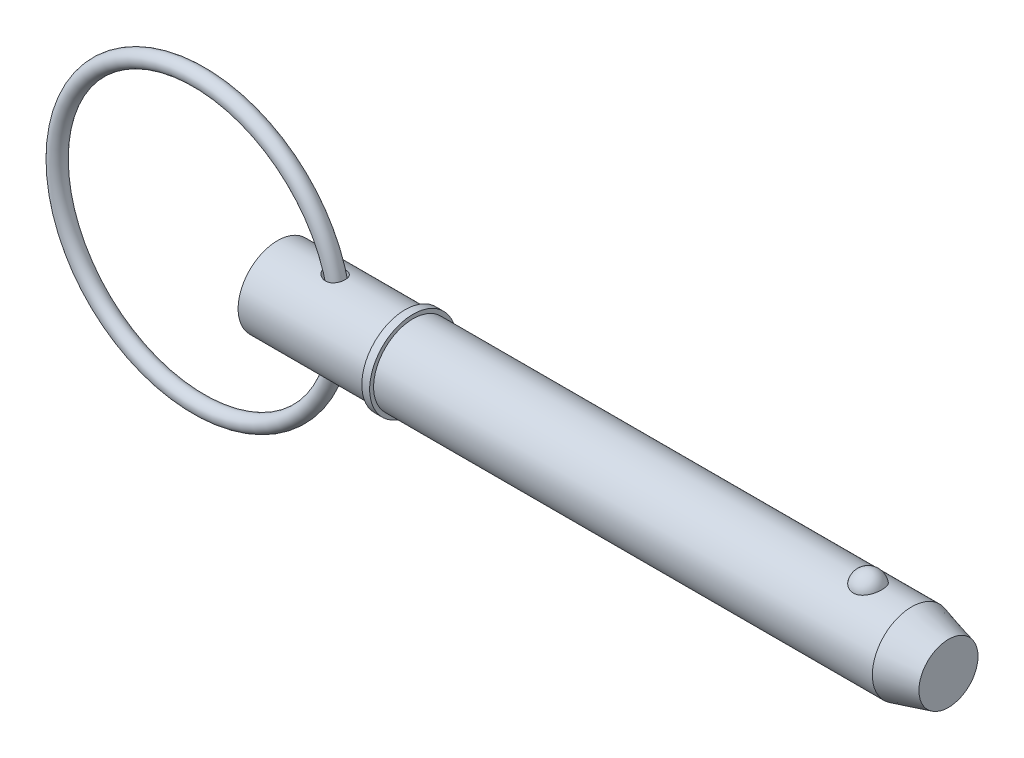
ISO-10303-21;
HEADER;
FILE_DESCRIPTION(('STEP AP214'),'2;1');
FILE_NAME('part.step','',(''),(''),'','','');
FILE_SCHEMA(('AUTOMOTIVE_DESIGN { 1 0 10303 214 1 1 1 1 }'));
ENDSEC;
DATA;
#1=APPLICATION_CONTEXT('core data for automotive mechanical design processes');
#2=APPLICATION_PROTOCOL_DEFINITION('international standard','automotive_design',2000,#1);
#3=PRODUCT_CONTEXT('',#1,'mechanical');
#4=PRODUCT('Part','Part','',(#3));
#5=PRODUCT_RELATED_PRODUCT_CATEGORY('part','',(#4));
#6=PRODUCT_DEFINITION_FORMATION('','',#4);
#7=PRODUCT_DEFINITION_CONTEXT('part definition',#1,'design');
#8=PRODUCT_DEFINITION('design','',#6,#7);
#9=PRODUCT_DEFINITION_SHAPE('','',#8);
#10=(LENGTH_UNIT() NAMED_UNIT(*) SI_UNIT(.MILLI.,.METRE.));
#11=(NAMED_UNIT(*) PLANE_ANGLE_UNIT() SI_UNIT($,.RADIAN.));
#12=(NAMED_UNIT(*) SI_UNIT($,.STERADIAN.) SOLID_ANGLE_UNIT());
#13=UNCERTAINTY_MEASURE_WITH_UNIT(LENGTH_MEASURE(1.E-05),#10,'distance_accuracy_value','');
#14=(GEOMETRIC_REPRESENTATION_CONTEXT(3) GLOBAL_UNCERTAINTY_ASSIGNED_CONTEXT((#13)) GLOBAL_UNIT_ASSIGNED_CONTEXT((#10,
#11,#12)) REPRESENTATION_CONTEXT('',''));
#15=CARTESIAN_POINT('',(0.,0.,0.));
#16=DIRECTION('',(0.,0.,1.));
#17=DIRECTION('',(1.,0.,0.));
#18=AXIS2_PLACEMENT_3D('',#15,#16,#17);
#19=CARTESIAN_POINT('',(-15.855506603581,0.,0.));
#20=DIRECTION('',(0.,0.,1.));
#21=DIRECTION('',(1.,0.,0.));
#22=AXIS2_PLACEMENT_3D('',#19,#20,#21);
#23=TOROIDAL_SURFACE('',#22,28.575,1.588);
#24=CARTESIAN_POINT('',(14.307493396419,0.,0.));
#25=VERTEX_POINT('',#24);
#26=VERTEX_LOOP('',#25);
#27=FACE_BOUND('',#26,.T.);
#28=ADVANCED_FACE('P0_F12',(#27),#23,.T.);
#29=CLOSED_SHELL('',(#28));
#30=MANIFOLD_SOLID_BREP('P0_B1',#29);
#31=CARTESIAN_POINT('',(0.,0.,0.));
#32=DIRECTION('',(1.,0.,0.));
#33=DIRECTION('',(0.,0.,-1.));
#34=AXIS2_PLACEMENT_3D('',#31,#32,#33);
#35=CYLINDRICAL_SURFACE('',#34,7.94);
#36=CARTESIAN_POINT('',(9.9064878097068,7.8609270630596,-1.11777712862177));
#37=CARTESIAN_POINT('',(9.98046148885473,7.84701054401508,-1.21564239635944));
#38=CARTESIAN_POINT('',(10.0632949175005,7.83217804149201,-1.30680329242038));
#39=CARTESIAN_POINT('',(10.243327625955,7.80247884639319,-1.47382688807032));
#40=CARTESIAN_POINT('',(10.3405572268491,7.78761214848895,-1.54965647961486));
#41=CARTESIAN_POINT('',(10.5460150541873,7.75960959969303,-1.6842723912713));
#42=CARTESIAN_POINT('',(10.654212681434,7.74646915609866,-1.74310445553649));
#43=CARTESIAN_POINT('',(10.8789333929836,7.72340979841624,-1.84259563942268));
#44=CARTESIAN_POINT('',(10.9954527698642,7.71348946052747,-1.88326279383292));
#45=CARTESIAN_POINT('',(11.2371543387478,7.69793327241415,-1.94589519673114));
#46=CARTESIAN_POINT('',(11.3624861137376,7.69242163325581,-1.96732022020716));
#47=CARTESIAN_POINT('',(11.6151110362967,7.68708151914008,-1.98809161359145));
#48=CARTESIAN_POINT('',(11.7424035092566,7.68725113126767,-1.98744541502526));
#49=CARTESIAN_POINT('',(11.9871377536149,7.69329740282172,-1.96389977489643));
#50=CARTESIAN_POINT('',(12.1047148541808,7.69883374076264,-1.94232728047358));
#51=CARTESIAN_POINT('',(12.3339179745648,7.7145667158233,-1.87886184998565));
#52=CARTESIAN_POINT('',(12.4455463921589,7.72476145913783,-1.83697717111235));
#53=CARTESIAN_POINT('',(12.6521036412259,7.74778151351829,-1.73721211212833));
#54=CARTESIAN_POINT('',(12.7476463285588,7.76039274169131,-1.68054854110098));
#55=CARTESIAN_POINT('',(12.9274536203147,7.78715828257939,-1.55179691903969));
#56=CARTESIAN_POINT('',(13.0117191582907,7.80131246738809,-1.47971014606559));
#57=CARTESIAN_POINT('',(13.16544092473,7.82932755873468,-1.32341211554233));
#58=CARTESIAN_POINT('',(13.2351086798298,7.84318958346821,-1.23940873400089));
#59=CARTESIAN_POINT('',(13.3595610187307,7.86933512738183,-1.06080152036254));
#60=CARTESIAN_POINT('',(13.4143450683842,7.88161858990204,-0.966197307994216));
#61=CARTESIAN_POINT('',(13.5082288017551,7.90340571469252,-0.767990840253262));
#62=CARTESIAN_POINT('',(13.5471601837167,7.91287927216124,-0.664305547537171));
#63=CARTESIAN_POINT('',(13.6076213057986,7.92785679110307,-0.451705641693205));
#64=CARTESIAN_POINT('',(13.6291504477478,7.93336061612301,-0.3427908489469));
#65=CARTESIAN_POINT('',(13.6544025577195,7.93983472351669,-0.122042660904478));
#66=CARTESIAN_POINT('',(13.6580055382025,7.94077445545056,-0.0101946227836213));
#67=CARTESIAN_POINT('',(13.6469977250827,7.93793630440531,0.212542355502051));
#68=CARTESIAN_POINT('',(13.6323866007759,7.93415833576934,0.323431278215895));
#69=CARTESIAN_POINT('',(13.5852649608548,7.92228583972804,0.541194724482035));
#70=CARTESIAN_POINT('',(13.5527398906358,7.91418780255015,0.648065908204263));
#71=CARTESIAN_POINT('',(13.4705326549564,7.8945509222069,0.854658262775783));
#72=CARTESIAN_POINT('',(13.4208502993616,7.88301204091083,0.954379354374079));
#73=CARTESIAN_POINT('',(13.3056021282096,7.85778224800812,1.14366619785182));
#74=CARTESIAN_POINT('',(13.2400609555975,7.8440946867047,1.23324739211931));
#75=CARTESIAN_POINT('',(13.0946981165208,7.8160855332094,1.39984119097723));
#76=CARTESIAN_POINT('',(13.0148777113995,7.80176399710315,1.47685490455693));
#77=CARTESIAN_POINT('',(12.8438529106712,7.774237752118,1.6154855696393));
#78=CARTESIAN_POINT('',(12.7527554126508,7.76102428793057,1.67723263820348));
#79=CARTESIAN_POINT('',(12.5611987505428,7.73705789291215,1.78453696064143));
#80=CARTESIAN_POINT('',(12.4607407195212,7.72630466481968,1.83009617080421));
#81=CARTESIAN_POINT('',(12.2541997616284,7.70849465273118,1.90371822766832));
#82=CARTESIAN_POINT('',(12.1481665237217,7.7014098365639,1.93191408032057));
#83=CARTESIAN_POINT('',(11.9327851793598,7.69148605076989,1.97105353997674));
#84=CARTESIAN_POINT('',(11.8234367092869,7.68864754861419,1.98199524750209));
#85=CARTESIAN_POINT('',(11.6016024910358,7.68735890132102,1.98698770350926));
#86=CARTESIAN_POINT('',(11.4891069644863,7.68902083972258,1.98060702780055));
#87=CARTESIAN_POINT('',(11.2665484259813,7.6966276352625,1.95083303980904));
#88=CARTESIAN_POINT('',(11.1564861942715,7.70257384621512,1.92743434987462));
#89=CARTESIAN_POINT('',(10.9339966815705,7.71853798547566,1.86251478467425));
#90=CARTESIAN_POINT('',(10.8219140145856,7.72880438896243,1.81987394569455));
#91=CARTESIAN_POINT('',(10.6060441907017,7.75216432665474,1.7176403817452));
#92=CARTESIAN_POINT('',(10.5022611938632,7.76525926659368,1.65803922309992));
#93=CARTESIAN_POINT('',(10.3000447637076,7.79362794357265,1.51929354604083));
#94=CARTESIAN_POINT('',(10.2022480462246,7.80898310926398,1.4392327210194));
#95=CARTESIAN_POINT('',(10.0221668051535,7.83939672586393,1.26310118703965));
#96=CARTESIAN_POINT('',(9.93988168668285,7.85445518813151,1.16703109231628));
#97=CARTESIAN_POINT('',(9.79729823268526,7.88178950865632,0.964874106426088));
#98=CARTESIAN_POINT('',(9.73627994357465,7.89414970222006,0.859310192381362));
#99=CARTESIAN_POINT('',(9.63554001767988,7.91508909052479,0.638143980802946));
#100=CARTESIAN_POINT('',(9.59578986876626,7.92367334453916,0.52255536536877));
#101=CARTESIAN_POINT('',(9.54388714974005,7.93499161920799,0.300466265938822));
#102=CARTESIAN_POINT('',(9.52888458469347,7.93832727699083,0.194660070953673));
#103=CARTESIAN_POINT('',(9.51823078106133,7.94068976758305,-0.0179747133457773));
#104=CARTESIAN_POINT('',(9.52257317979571,7.93971801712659,-0.124802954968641));
#105=CARTESIAN_POINT('',(9.54911264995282,7.93386114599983,-0.326814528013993));
#106=CARTESIAN_POINT('',(9.56976509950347,7.92931471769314,-0.422217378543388));
#107=CARTESIAN_POINT('',(9.62591284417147,7.91721462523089,-0.608271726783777));
#108=CARTESIAN_POINT('',(9.66139801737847,7.90966301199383,-0.698926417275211));
#109=CARTESIAN_POINT('',(9.7317197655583,7.89515389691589,-0.844763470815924));
#110=CARTESIAN_POINT('',(9.76292633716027,7.88881879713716,-0.90180107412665));
#111=CARTESIAN_POINT('',(9.83075962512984,7.87538342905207,-1.01244242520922));
#112=CARTESIAN_POINT('',(9.86738597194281,7.86828321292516,-1.06604640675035));
#113=CARTESIAN_POINT('',(9.9064878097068,7.8609270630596,-1.11777712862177));
#114=B_SPLINE_CURVE_WITH_KNOTS('',3,(#36,#37,#38,#39,#40,#41,#42,#43,#44,#45,#46,#47,#48,#49,
#50,#51,#52,#53,#54,#55,#56,#57,#58,#59,#60,#61,#62,#63,#64,#65,#66,#67,#68,#69,#70,#71,#72,#73,
#74,#75,#76,#77,#78,#79,#80,#81,#82,#83,#84,#85,#86,#87,#88,#89,#90,#91,#92,#93,#94,#95,#96,#97,
#98,#99,#100,#101,#102,#103,#104,#105,#106,#107,#108,#109,#110,#111,#112,#113),.UNSPECIFIED.,
.T.,.F.,(4,2,2,2,2,2,2,2,2,2,2,2,2,2,2,2,2,2,2,2,2,2,2,2,2,2,2,2,2,2,2,2,2,2,2,2,2,2,4),(0.,
0.370138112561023,0.741067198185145,1.11098852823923,1.48074607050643,1.86058657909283,
2.24029919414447,2.59740885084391,2.95437345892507,3.2881332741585,3.62186544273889,
3.95036374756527,4.27887384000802,4.61078596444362,4.94270949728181,5.27685177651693,
5.61100012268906,5.94542035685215,6.27984429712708,6.61375187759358,6.94762997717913,
7.27855592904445,7.60944187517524,7.93776058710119,8.26611544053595,8.60272268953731,
8.93943635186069,9.29895306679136,9.65864886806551,10.0387340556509,10.4188046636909,
10.7843533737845,11.1494107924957,11.4683925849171,11.7872694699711,12.0791172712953,
12.3707662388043,12.5664313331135,12.7620830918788),.UNSPECIFIED.);
#115=CARTESIAN_POINT('',(9.9064878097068,7.8609270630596,-1.11777712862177));
#116=VERTEX_POINT('',#115);
#117=EDGE_CURVE('P1_E42',#116,#116,#114,.T.);
#118=ORIENTED_EDGE('',*,*,#117,.T.);
#119=EDGE_LOOP('',(#118));
#120=FACE_BOUND('',#119,.T.);
#121=CARTESIAN_POINT('',(0.,0.,0.));
#122=DIRECTION('',(1.,0.,0.));
#123=DIRECTION('',(0.,0.,-1.));
#124=AXIS2_PLACEMENT_3D('',#121,#122,#123);
#125=CIRCLE('',#124,7.94);
#126=CARTESIAN_POINT('',(0.,0.,-7.94));
#127=VERTEX_POINT('',#126);
#128=EDGE_CURVE('P1_E9',#127,#127,#125,.T.);
#129=ORIENTED_EDGE('',*,*,#128,.T.);
#130=EDGE_LOOP('',(#129));
#131=FACE_BOUND('',#130,.T.);
#132=CARTESIAN_POINT('',(25.722,0.,0.));
#133=DIRECTION('',(1.,0.,0.));
#134=DIRECTION('',(0.,0.,-1.));
#135=AXIS2_PLACEMENT_3D('',#132,#133,#134);
#136=CIRCLE('',#135,7.94);
#137=CARTESIAN_POINT('',(25.722,0.,-7.94));
#138=VERTEX_POINT('',#137);
#139=EDGE_CURVE('P1_E25',#138,#138,#136,.T.);
#140=ORIENTED_EDGE('',*,*,#139,.F.);
#141=EDGE_LOOP('',(#140));
#142=FACE_BOUND('',#141,.T.);
#143=CARTESIAN_POINT('',(9.9064878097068,-7.8609270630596,-1.11777712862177));
#144=CARTESIAN_POINT('',(9.84378768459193,-7.87272256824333,-1.03482250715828));
#145=CARTESIAN_POINT('',(9.7874122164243,-7.88386682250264,-0.947002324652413));
#146=CARTESIAN_POINT('',(9.68947008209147,-7.90377389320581,-0.763202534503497));
#147=CARTESIAN_POINT('',(9.64789384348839,-7.91253824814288,-0.667228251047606));
#148=CARTESIAN_POINT('',(9.58141396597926,-7.92676779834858,-0.46889851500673));
#149=CARTESIAN_POINT('',(9.55658638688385,-7.93221793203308,-0.36651622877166));
#150=CARTESIAN_POINT('',(9.525398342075,-7.9390896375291,-0.158837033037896));
#151=CARTESIAN_POINT('',(9.51903196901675,-7.94051249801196,-0.0535410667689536));
#152=CARTESIAN_POINT('',(9.5249639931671,-7.93919670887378,0.149856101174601));
#153=CARTESIAN_POINT('',(9.53611757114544,-7.9367132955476,0.24799461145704));
#154=CARTESIAN_POINT('',(9.57435037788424,-7.92833496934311,0.44094918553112));
#155=CARTESIAN_POINT('',(9.60143086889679,-7.92243978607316,0.535764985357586));
#156=CARTESIAN_POINT('',(9.67027872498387,-7.90782830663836,0.720026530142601));
#157=CARTESIAN_POINT('',(9.71210005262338,-7.89910165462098,0.809451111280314));
#158=CARTESIAN_POINT('',(9.80864905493,-7.87966534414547,0.980775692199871));
#159=CARTESIAN_POINT('',(9.86338092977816,-7.86895504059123,1.06267323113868));
#160=CARTESIAN_POINT('',(9.99009906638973,-7.84531573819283,1.22559225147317));
#161=CARTESIAN_POINT('',(10.0632770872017,-7.8322718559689,1.30566871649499));
#162=CARTESIAN_POINT('',(10.2208237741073,-7.80611237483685,1.45392159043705));
#163=CARTESIAN_POINT('',(10.3051986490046,-7.79299674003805,1.52209134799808));
#164=CARTESIAN_POINT('',(10.4935539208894,-7.76638841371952,1.65280871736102));
#165=CARTESIAN_POINT('',(10.5986730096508,-7.75303312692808,1.71374951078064));
#166=CARTESIAN_POINT('',(10.8175805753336,-7.72920597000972,1.81820073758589));
#167=CARTESIAN_POINT('',(10.9313721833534,-7.71873514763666,1.86170483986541));
#168=CARTESIAN_POINT('',(11.1696833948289,-7.70161777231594,1.93133079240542));
#169=CARTESIAN_POINT('',(11.2944525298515,-7.69514907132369,1.95665138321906));
#170=CARTESIAN_POINT('',(11.5466607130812,-7.6877908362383,1.98537345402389));
#171=CARTESIAN_POINT('',(11.6740986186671,-7.68689896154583,1.98878412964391));
#172=CARTESIAN_POINT('',(11.9206005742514,-7.690938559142,1.97309854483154));
#173=CARTESIAN_POINT('',(12.0397453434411,-7.69555832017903,1.95520713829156));
#174=CARTESIAN_POINT('',(12.2727177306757,-7.70968728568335,1.89872693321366));
#175=CARTESIAN_POINT('',(12.3865475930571,-7.71919440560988,1.86014695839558));
#176=CARTESIAN_POINT('',(12.5975118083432,-7.74115679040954,1.76641559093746));
#177=CARTESIAN_POINT('',(12.6952552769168,-7.75336701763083,1.71257254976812));
#178=CARTESIAN_POINT('',(12.8798510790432,-7.77962828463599,1.58901145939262));
#179=CARTESIAN_POINT('',(12.9667044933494,-7.79367914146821,1.51929498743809));
#180=CARTESIAN_POINT('',(13.1254818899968,-7.82172079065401,1.36751778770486));
#181=CARTESIAN_POINT('',(13.1976693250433,-7.83570718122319,1.28573131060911));
#182=CARTESIAN_POINT('',(13.3274495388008,-7.86236718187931,1.11111271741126));
#183=CARTESIAN_POINT('',(13.3850418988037,-7.87504075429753,1.01828028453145));
#184=CARTESIAN_POINT('',(13.4847470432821,-7.89782512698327,0.823214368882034));
#185=CARTESIAN_POINT('',(13.5267056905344,-7.90791011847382,0.72089908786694));
#186=CARTESIAN_POINT('',(13.5933891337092,-7.92427335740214,0.510509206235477));
#187=CARTESIAN_POINT('',(13.6181132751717,-7.9305514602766,0.40243438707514));
#188=CARTESIAN_POINT('',(13.6498843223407,-7.93866355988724,0.182728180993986));
#189=CARTESIAN_POINT('',(13.6567982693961,-7.94046412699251,0.0710763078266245));
#190=CARTESIAN_POINT('',(13.6524060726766,-7.93933046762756,-0.151845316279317));
#191=CARTESIAN_POINT('',(13.6410996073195,-7.93639615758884,-0.263115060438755));
#192=CARTESIAN_POINT('',(13.6005023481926,-7.92610202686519,-0.482238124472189));
#193=CARTESIAN_POINT('',(13.571192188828,-7.91873744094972,-0.590087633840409));
#194=CARTESIAN_POINT('',(13.495246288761,-7.90037565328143,-0.799178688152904));
#195=CARTESIAN_POINT('',(13.4486102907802,-7.88937839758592,-0.900420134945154));
#196=CARTESIAN_POINT('',(13.3391817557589,-7.86497175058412,-1.09328280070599));
#197=CARTESIAN_POINT('',(13.2764083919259,-7.85156522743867,-1.18491525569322));
#198=CARTESIAN_POINT('',(13.1362355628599,-7.8238261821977,-1.35604994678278));
#199=CARTESIAN_POINT('',(13.0588372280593,-7.80949373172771,-1.43555311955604));
#200=CARTESIAN_POINT('',(12.8921392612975,-7.78164292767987,-1.57955181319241));
#201=CARTESIAN_POINT('',(12.8029410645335,-7.76811892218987,-1.64416363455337));
#202=CARTESIAN_POINT('',(12.6146622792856,-7.74328422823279,-1.75742016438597));
#203=CARTESIAN_POINT('',(12.5155829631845,-7.73197325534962,-1.80606692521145));
#204=CARTESIAN_POINT('',(12.31135301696,-7.71289290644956,-1.88588502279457));
#205=CARTESIAN_POINT('',(12.2062651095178,-7.70509254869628,-1.91720981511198));
#206=CARTESIAN_POINT('',(11.9922253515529,-7.69365188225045,-1.96261878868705));
#207=CARTESIAN_POINT('',(11.8832731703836,-7.69001193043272,-1.97670149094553));
#208=CARTESIAN_POINT('',(11.662174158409,-7.6871142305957,-1.98794112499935));
#209=CARTESIAN_POINT('',(11.5500082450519,-7.6879499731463,-1.98473694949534));
#210=CARTESIAN_POINT('',(11.3276038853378,-7.69396349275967,-1.96129119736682));
#211=CARTESIAN_POINT('',(11.2173659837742,-7.6991424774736,-1.94104488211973));
#212=CARTESIAN_POINT('',(10.9943151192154,-7.71363470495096,-1.8826578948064));
#213=CARTESIAN_POINT('',(10.8818004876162,-7.72319478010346,-1.8434396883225));
#214=CARTESIAN_POINT('',(10.6644693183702,-7.74534199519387,-1.74804607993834));
#215=CARTESIAN_POINT('',(10.5596578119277,-7.75793109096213,-1.69185971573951));
#216=CARTESIAN_POINT('',(10.3538333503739,-7.78563853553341,-1.55958016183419));
#217=CARTESIAN_POINT('',(10.2535123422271,-7.80086820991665,-1.48242881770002));
#218=CARTESIAN_POINT('',(10.0678634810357,-7.83136022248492,-1.31182139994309));
#219=CARTESIAN_POINT('',(9.98252491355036,-7.84662252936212,-1.21837707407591));
#220=CARTESIAN_POINT('',(9.9064878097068,-7.8609270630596,-1.11777712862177));
#221=B_SPLINE_CURVE_WITH_KNOTS('',3,(#143,#144,#145,#146,#147,#148,#149,#150,#151,#152,#153,
#154,#155,#156,#157,#158,#159,#160,#161,#162,#163,#164,#165,#166,#167,#168,#169,#170,#171,#172,
#173,#174,#175,#176,#177,#178,#179,#180,#181,#182,#183,#184,#185,#186,#187,#188,#189,#190,#191,
#192,#193,#194,#195,#196,#197,#198,#199,#200,#201,#202,#203,#204,#205,#206,#207,#208,#209,#210,
#211,#212,#213,#214,#215,#216,#217,#218,#219,#220),.UNSPECIFIED.,.T.,.F.,(4,2,2,2,2,2,2,2,2,2,2,
2,2,2,2,2,2,2,2,2,2,2,2,2,2,2,2,2,2,2,2,2,2,2,2,2,2,2,4),(0.,0.313593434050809,
0.626983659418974,0.941787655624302,1.25649090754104,1.55146990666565,1.84647228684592,
2.14256601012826,2.43875619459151,2.76521830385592,3.09186220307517,3.45696288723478,
3.82219601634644,4.20267276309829,4.58298981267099,4.94277962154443,5.30241610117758,
5.63754619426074,5.9726430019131,6.30104941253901,6.62946524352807,6.96103833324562,
7.29262401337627,7.62667800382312,7.96073789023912,8.29515773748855,8.62958255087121,
8.96361184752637,9.29761533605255,9.62891449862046,9.96017105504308,10.288443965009,
10.616745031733,10.951930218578,11.2872086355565,11.6442788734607,12.0015802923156,
12.3821516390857,12.762449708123),.UNSPECIFIED.);
#222=CARTESIAN_POINT('',(9.9064878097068,-7.8609270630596,-1.11777712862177));
#223=VERTEX_POINT('',#222);
#224=EDGE_CURVE('P1_E17',#223,#223,#221,.T.);
#225=ORIENTED_EDGE('',*,*,#224,.T.);
#226=EDGE_LOOP('',(#225));
#227=FACE_BOUND('',#226,.T.);
#228=ADVANCED_FACE('P1_F13',(#120,#131,#142,#227),#35,.T.);
#229=CARTESIAN_POINT('',(0.,0.,0.));
#230=DIRECTION('',(1.,0.,0.));
#231=DIRECTION('',(0.,0.,-1.));
#232=AXIS2_PLACEMENT_3D('',#229,#230,#231);
#233=CYLINDRICAL_SURFACE('',#232,7.94);
#234=CARTESIAN_POINT('',(127.851879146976,0.,0.));
#235=DIRECTION('',(1.,0.,0.));
#236=DIRECTION('',(0.,0.,-1.));
#237=AXIS2_PLACEMENT_3D('',#234,#235,#236);
#238=CIRCLE('',#237,7.94);
#239=CARTESIAN_POINT('',(127.851879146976,0.,-7.94));
#240=VERTEX_POINT('',#239);
#241=EDGE_CURVE('P1_E99',#240,#240,#238,.T.);
#242=ORIENTED_EDGE('',*,*,#241,.F.);
#243=EDGE_LOOP('',(#242));
#244=FACE_BOUND('',#243,.T.);
#245=CARTESIAN_POINT('',(27.31,0.,0.));
#246=DIRECTION('',(1.,0.,0.));
#247=DIRECTION('',(0.,0.,-1.));
#248=AXIS2_PLACEMENT_3D('',#245,#246,#247);
#249=CIRCLE('',#248,7.94);
#250=CARTESIAN_POINT('',(27.31,0.,-7.94));
#251=VERTEX_POINT('',#250);
#252=EDGE_CURVE('P1_E96',#251,#251,#249,.T.);
#253=ORIENTED_EDGE('',*,*,#252,.T.);
#254=EDGE_LOOP('',(#253));
#255=FACE_BOUND('',#254,.T.);
#256=CARTESIAN_POINT('',(119.044907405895,7.37767842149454,2.93486986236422));
#257=CARTESIAN_POINT('',(118.892749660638,7.3776732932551,2.93487505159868));
#258=CARTESIAN_POINT('',(118.740632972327,7.38258419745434,2.92262454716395));
#259=CARTESIAN_POINT('',(118.440928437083,7.40163229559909,2.87404196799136));
#260=CARTESIAN_POINT('',(118.293339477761,7.41576720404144,2.83771585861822));
#261=CARTESIAN_POINT('',(118.007018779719,7.4516157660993,2.74218769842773));
#262=CARTESIAN_POINT('',(117.868274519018,7.47331841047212,2.68301886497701));
#263=CARTESIAN_POINT('',(117.602882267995,7.52194082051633,2.54350967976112));
#264=CARTESIAN_POINT('',(117.476236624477,7.5488615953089,2.46316523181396));
#265=CARTESIAN_POINT('',(117.234534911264,7.60594671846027,2.2809037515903));
#266=CARTESIAN_POINT('',(117.119906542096,7.63618114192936,2.17844211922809));
#267=CARTESIAN_POINT('',(116.908878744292,7.69614046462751,1.95608495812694));
#268=CARTESIAN_POINT('',(116.812482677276,7.72586526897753,1.83618622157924));
#269=CARTESIAN_POINT('',(116.635938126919,7.78314821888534,1.57628086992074));
#270=CARTESIAN_POINT('',(116.556707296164,7.81055035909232,1.43561546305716));
#271=CARTESIAN_POINT('',(116.421797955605,7.85879631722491,1.14236334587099));
#272=CARTESIAN_POINT('',(116.366121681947,7.87963951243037,0.989775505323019));
#273=CARTESIAN_POINT('',(116.27881215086,7.91289645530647,0.674619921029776));
#274=CARTESIAN_POINT('',(116.24753090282,7.925186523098,0.511941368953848));
#275=CARTESIAN_POINT('',(116.210975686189,7.93958930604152,0.183247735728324));
#276=CARTESIAN_POINT('',(116.205701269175,7.94170219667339,0.0172327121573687));
#277=CARTESIAN_POINT('',(116.221231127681,7.93554931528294,-0.312672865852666));
#278=CARTESIAN_POINT('',(116.241925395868,7.92732732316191,-0.476569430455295));
#279=CARTESIAN_POINT('',(116.30878655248,7.90141534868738,-0.798305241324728));
#280=CARTESIAN_POINT('',(116.354953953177,7.88372517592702,-0.956144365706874));
#281=CARTESIAN_POINT('',(116.471898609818,7.84066230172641,-1.26152073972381));
#282=CARTESIAN_POINT('',(116.542704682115,7.81528060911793,-1.40904568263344));
#283=CARTESIAN_POINT('',(116.707478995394,7.7594867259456,-1.68950598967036));
#284=CARTESIAN_POINT('',(116.801448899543,7.72907417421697,-1.82244030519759));
#285=CARTESIAN_POINT('',(117.010839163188,7.66640424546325,-2.07032792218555));
#286=CARTESIAN_POINT('',(117.126315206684,7.63414223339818,-2.1852330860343));
#287=CARTESIAN_POINT('',(117.3759006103,7.57149681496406,-2.39329737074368));
#288=CARTESIAN_POINT('',(117.510008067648,7.54111321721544,-2.48645870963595));
#289=CARTESIAN_POINT('',(117.790111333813,7.48650742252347,-2.64628132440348));
#290=CARTESIAN_POINT('',(117.935760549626,7.46215900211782,-2.71350554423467));
#291=CARTESIAN_POINT('',(118.237425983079,7.42171253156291,-2.82226614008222));
#292=CARTESIAN_POINT('',(118.393438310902,7.40561140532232,-2.86381209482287));
#293=CARTESIAN_POINT('',(118.702970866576,7.3842679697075,-2.9183907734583));
#294=CARTESIAN_POINT('',(118.856222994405,7.37852109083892,-2.93275024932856));
#295=CARTESIAN_POINT('',(119.163070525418,7.37700973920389,-2.93655208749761));
#296=CARTESIAN_POINT('',(119.316665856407,7.38124333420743,-2.92599927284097));
#297=CARTESIAN_POINT('',(119.614990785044,7.39890635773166,-2.88102897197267));
#298=CARTESIAN_POINT('',(119.759848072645,7.41205491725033,-2.84733999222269));
#299=CARTESIAN_POINT('',(120.04164329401,7.445801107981,-2.75788206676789));
#300=CARTESIAN_POINT('',(120.178580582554,7.46639934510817,-2.70211132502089));
#301=CARTESIAN_POINT('',(120.444061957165,7.51339098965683,-2.56858908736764));
#302=CARTESIAN_POINT('',(120.572354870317,7.53990200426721,-2.49038067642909));
#303=CARTESIAN_POINT('',(120.814244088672,7.59569503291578,-2.31462737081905));
#304=CARTESIAN_POINT('',(120.927837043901,7.62497767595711,-2.21707808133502));
#305=CARTESIAN_POINT('',(121.14322156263,7.68489473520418,-1.99982049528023));
#306=CARTESIAN_POINT('',(121.244148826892,7.71552419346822,-1.87925337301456));
#307=CARTESIAN_POINT('',(121.425186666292,7.77353016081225,-1.62268826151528));
#308=CARTESIAN_POINT('',(121.505293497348,7.80090608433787,-1.4866875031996));
#309=CARTESIAN_POINT('',(121.645361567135,7.85047992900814,-1.19818413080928));
#310=CARTESIAN_POINT('',(121.704587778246,7.8724818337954,-1.04529016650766));
#311=CARTESIAN_POINT('',(121.797982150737,7.90785114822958,-0.731080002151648));
#312=CARTESIAN_POINT('',(121.832149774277,7.92121837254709,-0.569763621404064));
#313=CARTESIAN_POINT('',(121.874795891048,7.93797834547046,-0.242812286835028));
#314=CARTESIAN_POINT('',(121.883204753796,7.94134405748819,-0.0771668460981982));
#315=CARTESIAN_POINT('',(121.873962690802,7.93767937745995,0.253276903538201));
#316=CARTESIAN_POINT('',(121.856312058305,7.93064910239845,0.418075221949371));
#317=CARTESIAN_POINT('',(121.795424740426,7.90695571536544,0.741525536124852));
#318=CARTESIAN_POINT('',(121.752281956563,7.8903279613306,0.900197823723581));
#319=CARTESIAN_POINT('',(121.64135358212,7.84916386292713,1.20759654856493));
#320=CARTESIAN_POINT('',(121.57356656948,7.82462706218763,1.35632241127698));
#321=CARTESIAN_POINT('',(121.414371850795,7.7700669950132,1.64032869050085));
#322=CARTESIAN_POINT('',(121.322861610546,7.74002008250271,1.77554712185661));
#323=CARTESIAN_POINT('',(121.118296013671,7.67774175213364,2.02800648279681));
#324=CARTESIAN_POINT('',(121.005241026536,7.64551037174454,2.14524772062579));
#325=CARTESIAN_POINT('',(120.760831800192,7.58265895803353,2.35778002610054));
#326=CARTESIAN_POINT('',(120.629583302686,7.5520309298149,2.45319004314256));
#327=CARTESIAN_POINT('',(120.351601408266,7.49579792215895,2.61999897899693));
#328=CARTESIAN_POINT('',(120.204867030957,7.47019326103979,2.69139637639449));
#329=CARTESIAN_POINT('',(119.892947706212,7.42622216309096,2.8105324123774));
#330=CARTESIAN_POINT('',(119.727220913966,7.40825002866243,2.85700910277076));
#331=CARTESIAN_POINT('',(119.389279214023,7.38398348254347,2.9191685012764));
#332=CARTESIAN_POINT('',(119.21706702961,7.3776842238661,2.93486399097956));
#333=CARTESIAN_POINT('',(119.044907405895,7.37767842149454,2.93486986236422));
#334=B_SPLINE_CURVE_WITH_KNOTS('',3,(#256,#257,#258,#259,#260,#261,#262,#263,#264,#265,#266,
#267,#268,#269,#270,#271,#272,#273,#274,#275,#276,#277,#278,#279,#280,#281,#282,#283,#284,#285,
#286,#287,#288,#289,#290,#291,#292,#293,#294,#295,#296,#297,#298,#299,#300,#301,#302,#303,#304,
#305,#306,#307,#308,#309,#310,#311,#312,#313,#314,#315,#316,#317,#318,#319,#320,#321,#322,#323,
#324,#325,#326,#327,#328,#329,#330,#331,#332,#333),.UNSPECIFIED.,.T.,.F.,(4,2,2,2,2,2,2,2,2,2,2,
2,2,2,2,2,2,2,2,2,2,2,2,2,2,2,2,2,2,2,2,2,2,2,2,2,2,2,4),(0.,0.45584132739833,0.911569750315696,
1.36663794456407,1.8217942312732,2.28978983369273,2.7578716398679,3.24685368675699,
3.73588214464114,4.23184282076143,4.72779494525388,5.22165321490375,5.71552141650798,
6.20996917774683,6.70445245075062,7.20023431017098,7.69596557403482,8.18023418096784,
8.66432203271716,9.12410697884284,9.58380291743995,10.0296503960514,10.4755341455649,
10.9312349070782,11.3870393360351,11.8654416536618,12.3439299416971,12.8378875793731,
13.3318558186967,13.8271581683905,14.3224549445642,14.8159385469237,15.3094506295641,
15.8051323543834,16.3008055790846,16.7937101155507,17.2866458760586,17.8026240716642,
18.3183879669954),.UNSPECIFIED.);
#335=CARTESIAN_POINT('',(119.044907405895,7.37767842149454,2.93486986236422));
#336=VERTEX_POINT('',#335);
#337=EDGE_CURVE('P1_E34',#336,#336,#334,.T.);
#338=ORIENTED_EDGE('',*,*,#337,.T.);
#339=EDGE_LOOP('',(#338));
#340=FACE_BOUND('',#339,.T.);
#341=ADVANCED_FACE('P1_F46',(#244,#255,#340),#233,.T.);
#342=CARTESIAN_POINT('',(0.,0.,0.));
#343=DIRECTION('',(-1.,0.,0.));
#344=DIRECTION('',(0.,0.,1.));
#345=AXIS2_PLACEMENT_3D('',#342,#343,#344);
#346=PLANE('',#345);
#347=ORIENTED_EDGE('',*,*,#128,.F.);
#348=EDGE_LOOP('',(#347));
#349=FACE_BOUND('',#348,.T.);
#350=ADVANCED_FACE('P1_F15',(#349),#346,.T.);
#351=CARTESIAN_POINT('',(25.722,7.94,0.));
#352=DIRECTION('',(-1.,0.,0.));
#353=DIRECTION('',(0.,0.,1.));
#354=AXIS2_PLACEMENT_3D('',#351,#352,#353);
#355=PLANE('',#354);
#356=ORIENTED_EDGE('',*,*,#139,.T.);
#357=EDGE_LOOP('',(#356));
#358=FACE_BOUND('',#357,.T.);
#359=CARTESIAN_POINT('',(25.722,0.,0.));
#360=DIRECTION('',(1.,0.,0.));
#361=DIRECTION('',(0.,0.,-1.));
#362=AXIS2_PLACEMENT_3D('',#359,#360,#361);
#363=CIRCLE('',#362,8.734);
#364=CARTESIAN_POINT('',(25.722,0.,-8.734));
#365=VERTEX_POINT('',#364);
#366=EDGE_CURVE('P1_E30',#365,#365,#363,.T.);
#367=ORIENTED_EDGE('',*,*,#366,.F.);
#368=EDGE_LOOP('',(#367));
#369=FACE_BOUND('',#368,.T.);
#370=ADVANCED_FACE('P1_F81',(#358,#369),#355,.T.);
#371=CARTESIAN_POINT('',(0.,0.,0.));
#372=DIRECTION('',(1.,0.,0.));
#373=DIRECTION('',(0.,0.,-1.));
#374=AXIS2_PLACEMENT_3D('',#371,#372,#373);
#375=CYLINDRICAL_SURFACE('',#374,8.734);
#376=ORIENTED_EDGE('',*,*,#366,.T.);
#377=EDGE_LOOP('',(#376));
#378=FACE_BOUND('',#377,.T.);
#379=CARTESIAN_POINT('',(27.31,0.,0.));
#380=DIRECTION('',(1.,0.,0.));
#381=DIRECTION('',(0.,0.,-1.));
#382=AXIS2_PLACEMENT_3D('',#379,#380,#381);
#383=CIRCLE('',#382,8.734);
#384=CARTESIAN_POINT('',(27.31,0.,-8.734));
#385=VERTEX_POINT('',#384);
#386=EDGE_CURVE('P1_E95',#385,#385,#383,.T.);
#387=ORIENTED_EDGE('',*,*,#386,.F.);
#388=EDGE_LOOP('',(#387));
#389=FACE_BOUND('',#388,.T.);
#390=ADVANCED_FACE('P1_F68',(#378,#389),#375,.T.);
#391=CARTESIAN_POINT('',(27.31,8.734,0.));
#392=DIRECTION('',(1.,0.,0.));
#393=DIRECTION('',(0.,0.,-1.));
#394=AXIS2_PLACEMENT_3D('',#391,#392,#393);
#395=PLANE('',#394);
#396=ORIENTED_EDGE('',*,*,#386,.T.);
#397=EDGE_LOOP('',(#396));
#398=FACE_BOUND('',#397,.T.);
#399=ORIENTED_EDGE('',*,*,#252,.F.);
#400=EDGE_LOOP('',(#399));
#401=FACE_BOUND('',#400,.T.);
#402=ADVANCED_FACE('P1_F62',(#398,#401),#395,.T.);
#403=CARTESIAN_POINT('',(135.26,0.,0.));
#404=DIRECTION('',(-1.,0.,0.));
#405=DIRECTION('',(0.,0.,1.));
#406=AXIS2_PLACEMENT_3D('',#403,#404,#405);
#407=CONICAL_SURFACE('',#406,5.95500000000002,0.26179938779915);
#408=ORIENTED_EDGE('',*,*,#241,.T.);
#409=EDGE_LOOP('',(#408));
#410=FACE_BOUND('',#409,.T.);
#411=CARTESIAN_POINT('',(135.26,0.,0.));
#412=DIRECTION('',(1.,0.,0.));
#413=DIRECTION('',(0.,0.,-1.));
#414=AXIS2_PLACEMENT_3D('',#411,#412,#413);
#415=CIRCLE('',#414,5.95500000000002);
#416=CARTESIAN_POINT('',(135.26,0.,-5.95500000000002));
#417=VERTEX_POINT('',#416);
#418=EDGE_CURVE('P1_E41',#417,#417,#415,.T.);
#419=ORIENTED_EDGE('',*,*,#418,.F.);
#420=EDGE_LOOP('',(#419));
#421=FACE_BOUND('',#420,.T.);
#422=ADVANCED_FACE('P1_F59',(#410,#421),#407,.T.);
#423=CARTESIAN_POINT('',(135.26,5.95500000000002,0.));
#424=DIRECTION('',(1.,0.,0.));
#425=DIRECTION('',(0.,0.,-1.));
#426=AXIS2_PLACEMENT_3D('',#423,#424,#425);
#427=PLANE('',#426);
#428=ORIENTED_EDGE('',*,*,#418,.T.);
#429=EDGE_LOOP('',(#428));
#430=FACE_BOUND('',#429,.T.);
#431=ADVANCED_FACE('P1_F55',(#430),#427,.T.);
#432=CARTESIAN_POINT('',(119.044907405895,7.14599999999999,0.));
#433=DIRECTION('',(-1.,0.,0.));
#434=DIRECTION('',(0.,-1.,0.));
#435=AXIS2_PLACEMENT_3D('',#432,#433,#434);
#436=SPHERICAL_SURFACE('',#435,2.944);
#437=ORIENTED_EDGE('',*,*,#337,.F.);
#438=EDGE_LOOP('',(#437));
#439=FACE_BOUND('',#438,.T.);
#440=ADVANCED_FACE('P1_F50',(#439),#436,.T.);
#441=CARTESIAN_POINT('',(-15.855506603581,0.,0.));
#442=DIRECTION('',(0.,0.,1.));
#443=DIRECTION('',(1.,0.,0.));
#444=AXIS2_PLACEMENT_3D('',#441,#442,#443);
#445=TOROIDAL_SURFACE('',#444,28.575,1.985);
#446=ORIENTED_EDGE('',*,*,#224,.F.);
#447=EDGE_LOOP('',(#446));
#448=FACE_BOUND('',#447,.T.);
#449=ORIENTED_EDGE('',*,*,#117,.F.);
#450=EDGE_LOOP('',(#449));
#451=FACE_BOUND('',#450,.T.);
#452=ADVANCED_FACE('P1_F54',(#448,#451),#445,.F.);
#453=CLOSED_SHELL('',(#228,#341,#350,#370,#390,#402,#422,#431,#440,#452));
#454=MANIFOLD_SOLID_BREP('P1_B1',#453);
#455=ADVANCED_BREP_SHAPE_REPRESENTATION('',(#18,#30,#454),#14);
#456=SHAPE_DEFINITION_REPRESENTATION(#9,#455);
ENDSEC;
END-ISO-10303-21;
